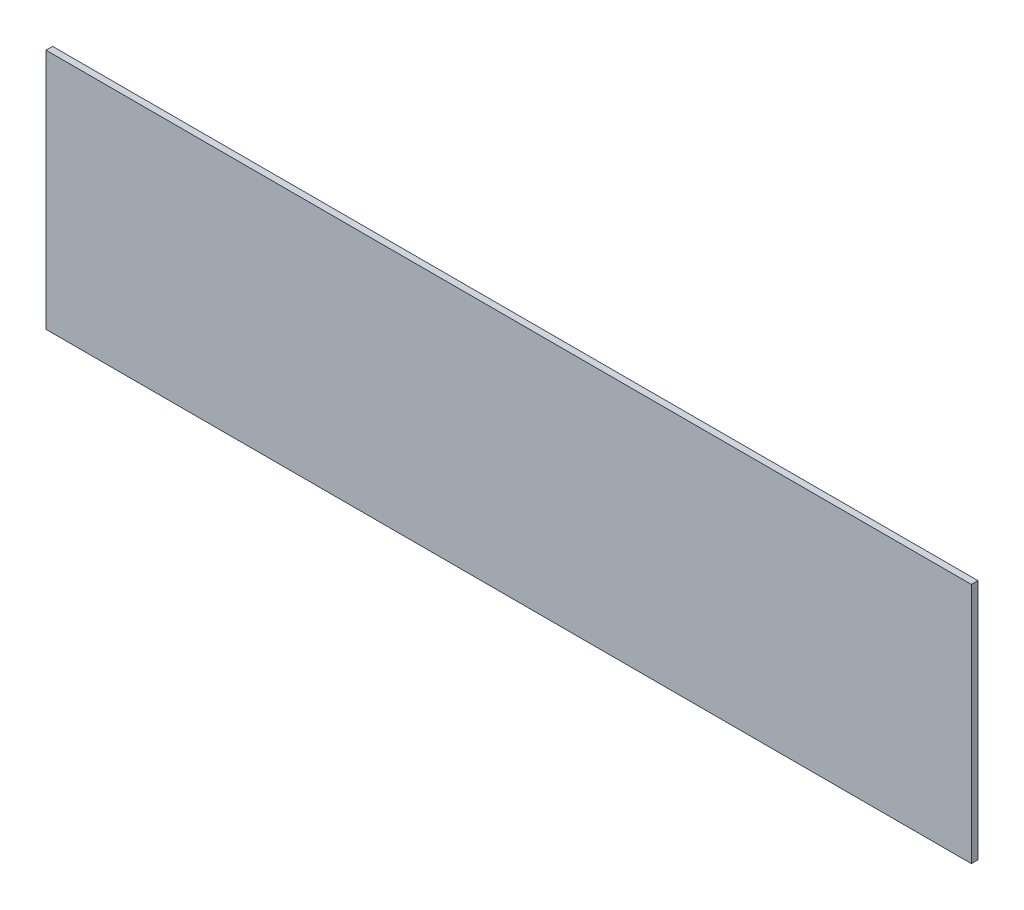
ISO-10303-21;
HEADER;
FILE_DESCRIPTION(('STEP AP214'),'2;1');
FILE_NAME('part.step','',(''),(''),'','','');
FILE_SCHEMA(('AUTOMOTIVE_DESIGN { 1 0 10303 214 1 1 1 1 }'));
ENDSEC;
DATA;
#1=APPLICATION_CONTEXT('core data for automotive mechanical design processes');
#2=APPLICATION_PROTOCOL_DEFINITION('international standard','automotive_design',2000,#1);
#3=PRODUCT_CONTEXT('',#1,'mechanical');
#4=PRODUCT('Part','Part','',(#3));
#5=PRODUCT_RELATED_PRODUCT_CATEGORY('part','',(#4));
#6=PRODUCT_DEFINITION_FORMATION('','',#4);
#7=PRODUCT_DEFINITION_CONTEXT('part definition',#1,'design');
#8=PRODUCT_DEFINITION('design','',#6,#7);
#9=PRODUCT_DEFINITION_SHAPE('','',#8);
#10=(LENGTH_UNIT() NAMED_UNIT(*) SI_UNIT(.MILLI.,.METRE.));
#11=(NAMED_UNIT(*) PLANE_ANGLE_UNIT() SI_UNIT($,.RADIAN.));
#12=(NAMED_UNIT(*) SI_UNIT($,.STERADIAN.) SOLID_ANGLE_UNIT());
#13=UNCERTAINTY_MEASURE_WITH_UNIT(LENGTH_MEASURE(1.E-05),#10,'distance_accuracy_value','');
#14=(GEOMETRIC_REPRESENTATION_CONTEXT(3) GLOBAL_UNCERTAINTY_ASSIGNED_CONTEXT((#13)) GLOBAL_UNIT_ASSIGNED_CONTEXT((#10,
#11,#12)) REPRESENTATION_CONTEXT('',''));
#15=CARTESIAN_POINT('',(0.,0.,0.));
#16=DIRECTION('',(0.,0.,1.));
#17=DIRECTION('',(1.,0.,0.));
#18=AXIS2_PLACEMENT_3D('',#15,#16,#17);
#19=CARTESIAN_POINT('',(0.,0.,3.));
#20=DIRECTION('',(1.,0.,0.));
#21=DIRECTION('',(0.,0.,-1.));
#22=AXIS2_PLACEMENT_3D('',#19,#20,#21);
#23=PLANE('',#22);
#24=DIRECTION('',(0.,-1.,0.));
#25=VECTOR('',#24,1.);
#26=CARTESIAN_POINT('',(0.,0.,0.));
#27=LINE('',#26,#25);
#28=CARTESIAN_POINT('',(0.,110.,0.));
#29=VERTEX_POINT('',#28);
#30=CARTESIAN_POINT('',(0.,0.,0.));
#31=VERTEX_POINT('',#30);
#32=EDGE_CURVE('E128',#29,#31,#27,.T.);
#33=ORIENTED_EDGE('',*,*,#32,.T.);
#34=DIRECTION('',(0.,0.,-1.));
#35=VECTOR('',#34,1.);
#36=CARTESIAN_POINT('',(0.,0.,3.));
#37=LINE('',#36,#35);
#38=CARTESIAN_POINT('',(0.,0.,3.));
#39=VERTEX_POINT('',#38);
#40=EDGE_CURVE('E12',#39,#31,#37,.T.);
#41=ORIENTED_EDGE('',*,*,#40,.F.);
#42=DIRECTION('',(0.,-1.,0.));
#43=VECTOR('',#42,1.);
#44=CARTESIAN_POINT('',(0.,0.,3.));
#45=LINE('',#44,#43);
#46=CARTESIAN_POINT('',(0.,110.,3.));
#47=VERTEX_POINT('',#46);
#48=EDGE_CURVE('E97',#47,#39,#45,.T.);
#49=ORIENTED_EDGE('',*,*,#48,.F.);
#50=DIRECTION('',(0.,0.,-1.));
#51=VECTOR('',#50,1.);
#52=CARTESIAN_POINT('',(0.,110.,3.));
#53=LINE('',#52,#51);
#54=EDGE_CURVE('E108',#47,#29,#53,.T.);
#55=ORIENTED_EDGE('',*,*,#54,.T.);
#56=EDGE_LOOP('',(#33,#41,#49,#55));
#57=FACE_BOUND('',#56,.T.);
#58=ADVANCED_FACE('F46',(#57),#23,.F.);
#59=CARTESIAN_POINT('',(0.,0.,3.));
#60=DIRECTION('',(0.,1.,0.));
#61=DIRECTION('',(0.,0.,1.));
#62=AXIS2_PLACEMENT_3D('',#59,#60,#61);
#63=PLANE('',#62);
#64=DIRECTION('',(1.,0.,0.));
#65=VECTOR('',#64,1.);
#66=CARTESIAN_POINT('',(0.,0.,0.));
#67=LINE('',#66,#65);
#68=CARTESIAN_POINT('',(421.,0.,0.));
#69=VERTEX_POINT('',#68);
#70=EDGE_CURVE('E102',#31,#69,#67,.T.);
#71=ORIENTED_EDGE('',*,*,#70,.T.);
#72=DIRECTION('',(0.,0.,-1.));
#73=VECTOR('',#72,1.);
#74=CARTESIAN_POINT('',(421.,0.,3.));
#75=LINE('',#74,#73);
#76=CARTESIAN_POINT('',(421.,0.,3.));
#77=VERTEX_POINT('',#76);
#78=EDGE_CURVE('E54',#77,#69,#75,.T.);
#79=ORIENTED_EDGE('',*,*,#78,.F.);
#80=DIRECTION('',(1.,0.,0.));
#81=VECTOR('',#80,1.);
#82=CARTESIAN_POINT('',(0.,0.,3.));
#83=LINE('',#82,#81);
#84=EDGE_CURVE('E92',#39,#77,#83,.T.);
#85=ORIENTED_EDGE('',*,*,#84,.F.);
#86=ORIENTED_EDGE('',*,*,#40,.T.);
#87=EDGE_LOOP('',(#71,#79,#85,#86));
#88=FACE_BOUND('',#87,.T.);
#89=ADVANCED_FACE('F101',(#88),#63,.F.);
#90=CARTESIAN_POINT('',(421.,0.,3.));
#91=DIRECTION('',(-1.,0.,0.));
#92=DIRECTION('',(0.,0.,1.));
#93=AXIS2_PLACEMENT_3D('',#90,#91,#92);
#94=PLANE('',#93);
#95=DIRECTION('',(0.,1.,0.));
#96=VECTOR('',#95,1.);
#97=CARTESIAN_POINT('',(421.,0.,0.));
#98=LINE('',#97,#96);
#99=CARTESIAN_POINT('',(421.,110.,0.));
#100=VERTEX_POINT('',#99);
#101=EDGE_CURVE('E79',#69,#100,#98,.T.);
#102=ORIENTED_EDGE('',*,*,#101,.T.);
#103=DIRECTION('',(0.,0.,-1.));
#104=VECTOR('',#103,1.);
#105=CARTESIAN_POINT('',(421.,110.,3.));
#106=LINE('',#105,#104);
#107=CARTESIAN_POINT('',(421.,110.,3.));
#108=VERTEX_POINT('',#107);
#109=EDGE_CURVE('E103',#108,#100,#106,.T.);
#110=ORIENTED_EDGE('',*,*,#109,.F.);
#111=DIRECTION('',(0.,1.,0.));
#112=VECTOR('',#111,1.);
#113=CARTESIAN_POINT('',(421.,0.,3.));
#114=LINE('',#113,#112);
#115=EDGE_CURVE('E95',#77,#108,#114,.T.);
#116=ORIENTED_EDGE('',*,*,#115,.F.);
#117=ORIENTED_EDGE('',*,*,#78,.T.);
#118=EDGE_LOOP('',(#102,#110,#116,#117));
#119=FACE_BOUND('',#118,.T.);
#120=ADVANCED_FACE('F104',(#119),#94,.F.);
#121=CARTESIAN_POINT('',(0.,110.,3.));
#122=DIRECTION('',(0.,-1.,0.));
#123=DIRECTION('',(0.,0.,-1.));
#124=AXIS2_PLACEMENT_3D('',#121,#122,#123);
#125=PLANE('',#124);
#126=DIRECTION('',(-1.,0.,0.));
#127=VECTOR('',#126,1.);
#128=CARTESIAN_POINT('',(0.,110.,0.));
#129=LINE('',#128,#127);
#130=EDGE_CURVE('E85',#100,#29,#129,.T.);
#131=ORIENTED_EDGE('',*,*,#130,.T.);
#132=ORIENTED_EDGE('',*,*,#54,.F.);
#133=DIRECTION('',(-1.,0.,0.));
#134=VECTOR('',#133,1.);
#135=CARTESIAN_POINT('',(0.,110.,3.));
#136=LINE('',#135,#134);
#137=EDGE_CURVE('E62',#108,#47,#136,.T.);
#138=ORIENTED_EDGE('',*,*,#137,.F.);
#139=ORIENTED_EDGE('',*,*,#109,.T.);
#140=EDGE_LOOP('',(#131,#132,#138,#139));
#141=FACE_BOUND('',#140,.T.);
#142=ADVANCED_FACE('F123',(#141),#125,.F.);
#143=CARTESIAN_POINT('',(0.,0.,3.));
#144=DIRECTION('',(0.,0.,-1.));
#145=DIRECTION('',(-1.,0.,0.));
#146=AXIS2_PLACEMENT_3D('',#143,#144,#145);
#147=PLANE('',#146);
#148=ORIENTED_EDGE('',*,*,#48,.T.);
#149=ORIENTED_EDGE('',*,*,#84,.T.);
#150=ORIENTED_EDGE('',*,*,#115,.T.);
#151=ORIENTED_EDGE('',*,*,#137,.T.);
#152=EDGE_LOOP('',(#148,#149,#150,#151));
#153=FACE_BOUND('',#152,.T.);
#154=ADVANCED_FACE('F93',(#153),#147,.F.);
#155=CARTESIAN_POINT('',(0.,0.,0.));
#156=DIRECTION('',(0.,0.,-1.));
#157=DIRECTION('',(-1.,0.,0.));
#158=AXIS2_PLACEMENT_3D('',#155,#156,#157);
#159=PLANE('',#158);
#160=ORIENTED_EDGE('',*,*,#32,.F.);
#161=ORIENTED_EDGE('',*,*,#130,.F.);
#162=ORIENTED_EDGE('',*,*,#101,.F.);
#163=ORIENTED_EDGE('',*,*,#70,.F.);
#164=EDGE_LOOP('',(#160,#161,#162,#163));
#165=FACE_BOUND('',#164,.T.);
#166=ADVANCED_FACE('F126',(#165),#159,.T.);
#167=CLOSED_SHELL('',(#58,#89,#120,#142,#154,#166));
#168=MANIFOLD_SOLID_BREP('B2',#167);
#169=ADVANCED_BREP_SHAPE_REPRESENTATION('',(#18,#168),#14);
#170=SHAPE_DEFINITION_REPRESENTATION(#9,#169);
ENDSEC;
END-ISO-10303-21;
